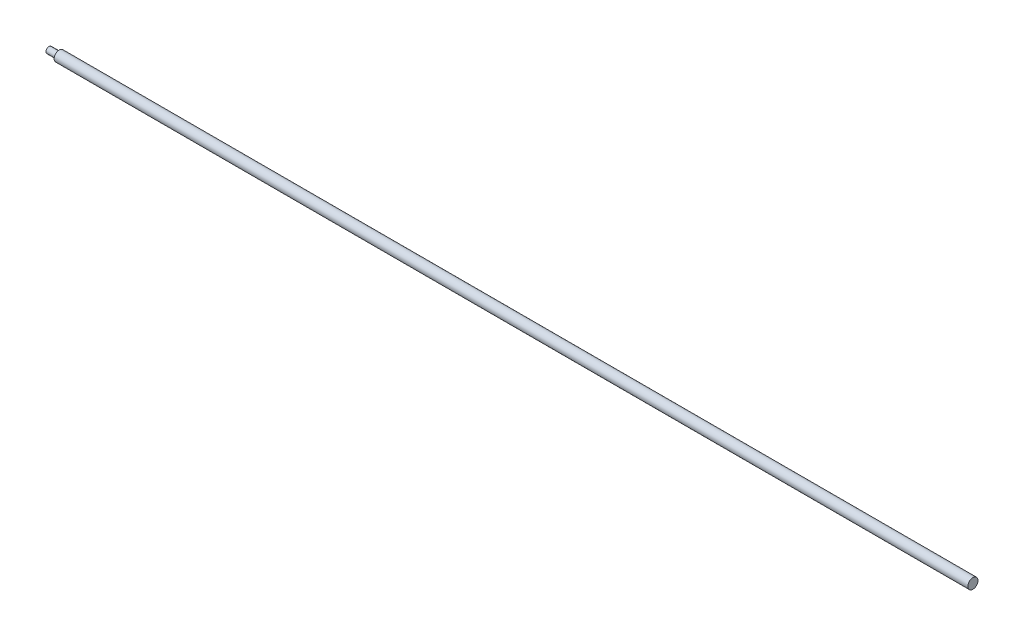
ISO-10303-21;
HEADER;
FILE_DESCRIPTION(('STEP AP214'),'2;1');
FILE_NAME('part.step','',(''),(''),'','','');
FILE_SCHEMA(('AUTOMOTIVE_DESIGN { 1 0 10303 214 1 1 1 1 }'));
ENDSEC;
DATA;
#1=APPLICATION_CONTEXT('core data for automotive mechanical design processes');
#2=APPLICATION_PROTOCOL_DEFINITION('international standard','automotive_design',2000,#1);
#3=PRODUCT_CONTEXT('',#1,'mechanical');
#4=PRODUCT('Part','Part','',(#3));
#5=PRODUCT_RELATED_PRODUCT_CATEGORY('part','',(#4));
#6=PRODUCT_DEFINITION_FORMATION('','',#4);
#7=PRODUCT_DEFINITION_CONTEXT('part definition',#1,'design');
#8=PRODUCT_DEFINITION('design','',#6,#7);
#9=PRODUCT_DEFINITION_SHAPE('','',#8);
#10=(LENGTH_UNIT() NAMED_UNIT(*) SI_UNIT(.MILLI.,.METRE.));
#11=(NAMED_UNIT(*) PLANE_ANGLE_UNIT() SI_UNIT($,.RADIAN.));
#12=(NAMED_UNIT(*) SI_UNIT($,.STERADIAN.) SOLID_ANGLE_UNIT());
#13=UNCERTAINTY_MEASURE_WITH_UNIT(LENGTH_MEASURE(1.E-05),#10,'distance_accuracy_value','');
#14=(GEOMETRIC_REPRESENTATION_CONTEXT(3) GLOBAL_UNCERTAINTY_ASSIGNED_CONTEXT((#13)) GLOBAL_UNIT_ASSIGNED_CONTEXT((#10,
#11,#12)) REPRESENTATION_CONTEXT('',''));
#15=CARTESIAN_POINT('',(0.,0.,0.));
#16=DIRECTION('',(0.,0.,1.));
#17=DIRECTION('',(1.,0.,0.));
#18=AXIS2_PLACEMENT_3D('',#15,#16,#17);
#19=CARTESIAN_POINT('',(910.000000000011,-7.0603245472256E-13,-9.71445146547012E-13));
#20=DIRECTION('',(-1.00000000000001,0.,0.));
#21=DIRECTION('',(0.,0.,1.));
#22=AXIS2_PLACEMENT_3D('',#19,#20,#21);
#23=CYLINDRICAL_SURFACE('',#22,5.);
#24=CARTESIAN_POINT('',(910.000000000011,-7.0603245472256E-13,-9.71445146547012E-13));
#25=DIRECTION('',(1.00000000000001,0.,0.));
#26=DIRECTION('',(0.,0.,-1.));
#27=AXIS2_PLACEMENT_3D('',#24,#25,#26);
#28=CIRCLE('',#27,5.);
#29=CARTESIAN_POINT('',(910.000000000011,-6.86325996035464E-13,-5.00000000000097));
#30=VERTEX_POINT('',#29);
#31=EDGE_CURVE('E11',#30,#30,#28,.T.);
#32=ORIENTED_EDGE('',*,*,#31,.F.);
#33=EDGE_LOOP('',(#32));
#34=FACE_BOUND('',#33,.T.);
#35=CARTESIAN_POINT('',(10.0000000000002,0.,0.));
#36=DIRECTION('',(-1.00000000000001,0.,0.));
#37=DIRECTION('',(0.,0.,1.));
#38=AXIS2_PLACEMENT_3D('',#35,#36,#37);
#39=CIRCLE('',#38,5.);
#40=CARTESIAN_POINT('',(10.0000000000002,0.,5.));
#41=VERTEX_POINT('',#40);
#42=EDGE_CURVE('E46',#41,#41,#39,.T.);
#43=ORIENTED_EDGE('',*,*,#42,.F.);
#44=EDGE_LOOP('',(#43));
#45=FACE_BOUND('',#44,.T.);
#46=ADVANCED_FACE('F43',(#34,#45),#23,.T.);
#47=CARTESIAN_POINT('',(910.000000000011,-7.0603245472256E-13,-9.71445146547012E-13));
#48=DIRECTION('',(1.00000000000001,0.,0.));
#49=DIRECTION('',(0.,0.,-1.));
#50=AXIS2_PLACEMENT_3D('',#47,#48,#49);
#51=PLANE('',#50);
#52=ORIENTED_EDGE('',*,*,#31,.T.);
#53=EDGE_LOOP('',(#52));
#54=FACE_BOUND('',#53,.T.);
#55=ADVANCED_FACE('F77',(#54),#51,.T.);
#56=CARTESIAN_POINT('',(10.0000000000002,0.,0.));
#57=DIRECTION('',(-1.00000000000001,0.,0.));
#58=DIRECTION('',(0.,0.,1.));
#59=AXIS2_PLACEMENT_3D('',#56,#57,#58);
#60=PLANE('',#59);
#61=CARTESIAN_POINT('',(10.0000000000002,0.,0.));
#62=DIRECTION('',(-1.00000000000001,0.,0.));
#63=DIRECTION('',(0.,0.,1.));
#64=AXIS2_PLACEMENT_3D('',#61,#62,#63);
#65=CIRCLE('',#64,3.);
#66=CARTESIAN_POINT('',(10.0000000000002,0.,2.99999999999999));
#67=VERTEX_POINT('',#66);
#68=EDGE_CURVE('E56',#67,#67,#65,.T.);
#69=ORIENTED_EDGE('',*,*,#68,.F.);
#70=EDGE_LOOP('',(#69));
#71=FACE_BOUND('',#70,.T.);
#72=ORIENTED_EDGE('',*,*,#42,.T.);
#73=EDGE_LOOP('',(#72));
#74=FACE_BOUND('',#73,.T.);
#75=ADVANCED_FACE('F69',(#71,#74),#60,.T.);
#76=CARTESIAN_POINT('',(10.0000000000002,0.,0.));
#77=DIRECTION('',(-1.00000000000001,0.,0.));
#78=DIRECTION('',(0.,0.,1.));
#79=AXIS2_PLACEMENT_3D('',#76,#77,#78);
#80=CYLINDRICAL_SURFACE('',#79,3.);
#81=ORIENTED_EDGE('',*,*,#68,.T.);
#82=EDGE_LOOP('',(#81));
#83=FACE_BOUND('',#82,.T.);
#84=CARTESIAN_POINT('',(0.,0.,0.));
#85=DIRECTION('',(-1.00000000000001,0.,0.));
#86=DIRECTION('',(0.,0.,1.));
#87=AXIS2_PLACEMENT_3D('',#84,#85,#86);
#88=CIRCLE('',#87,3.);
#89=CARTESIAN_POINT('',(0.,0.,3.));
#90=VERTEX_POINT('',#89);
#91=EDGE_CURVE('E60',#90,#90,#88,.T.);
#92=ORIENTED_EDGE('',*,*,#91,.F.);
#93=EDGE_LOOP('',(#92));
#94=FACE_BOUND('',#93,.T.);
#95=ADVANCED_FACE('F67',(#83,#94),#80,.T.);
#96=CARTESIAN_POINT('',(0.,0.,0.));
#97=DIRECTION('',(1.00000000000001,0.,0.));
#98=DIRECTION('',(0.,0.,-1.));
#99=AXIS2_PLACEMENT_3D('',#96,#97,#98);
#100=PLANE('',#99);
#101=ORIENTED_EDGE('',*,*,#91,.T.);
#102=EDGE_LOOP('',(#101));
#103=FACE_BOUND('',#102,.T.);
#104=ADVANCED_FACE('F65',(#103),#100,.F.);
#105=CLOSED_SHELL('',(#46,#55,#75,#95,#104));
#106=MANIFOLD_SOLID_BREP('B2',#105);
#107=ADVANCED_BREP_SHAPE_REPRESENTATION('',(#18,#106),#14);
#108=SHAPE_DEFINITION_REPRESENTATION(#9,#107);
ENDSEC;
END-ISO-10303-21;
